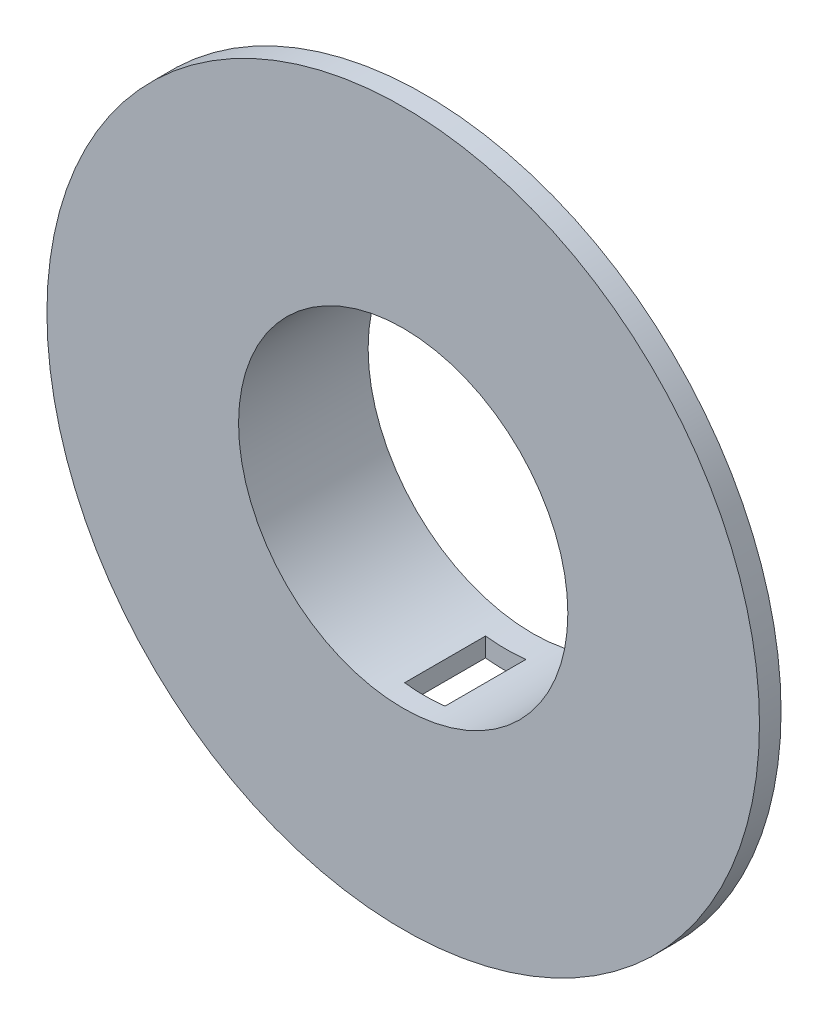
from build123d import *

# Parameters (mm, degrees)
SKETCH_4_R               = 66
EXTRUDE_2_DEPTH          = 4
SKETCH_5_R               = 30.5
CUT_EXTRUDE_1_DEPTH      = 30
SKETCH_6_R               = 34
EXTRUDE_3_DEPTH          = 20
SKETCH_7_R               = 30.5
CUT_EXTRUDE_2_DEPTH      = 97.374270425
CUT_EXTRUDE_3_DEPTH      = 96.45679651
CUT_EXTRUDE_3_DEPTH_BACK = 96.45679651
SKETCH_8_W               = 7.5
SKETCH_8_H               = 15


with BuildPart() as part:
    # Sketch 4 → Extrude 2 (new body)
    with BuildSketch(Plane.XY):
        Circle(SKETCH_4_R)
    extrude(amount=EXTRUDE_2_DEPTH)

    # Sketch 5 → Cut-Extrude 1 (cut)
    with BuildSketch(Plane.XY.offset(4)):
        Circle(SKETCH_5_R)
    extrude(amount=-CUT_EXTRUDE_1_DEPTH, mode=Mode.SUBTRACT)

    # Sketch 6 → Extrude 3 (add)
    with BuildSketch(Plane(origin=(0, 0, 0), x_dir=(-1, 0, 0), z_dir=(0, 0, -1))):
        Circle(SKETCH_6_R)
    extrude(amount=EXTRUDE_3_DEPTH)

    # Sketch 7 → Cut-Extrude 2 (cut, through all)
    with BuildSketch(Plane(origin=(0, 0, -20), x_dir=(-1, 0, 0), z_dir=(0, 0, -1))):
        with Locations(Location((0, 0, 0), (0, 0, 180))):
            Circle(SKETCH_7_R)
    extrude(amount=-CUT_EXTRUDE_2_DEPTH, mode=Mode.SUBTRACT)

    # Sketch 8 → Cut-Extrude 3 (cut, two sides: drawn at the far end of the back side and taken through both)
    with BuildSketch(Plane(origin=(0, 0, 0), x_dir=(1, 0, 0), z_dir=(0, 1, 0)).offset(-CUT_EXTRUDE_3_DEPTH_BACK)):
        with Locations((0, 7.5)):
            Rectangle(SKETCH_8_W, SKETCH_8_H)
    extrude(amount=CUT_EXTRUDE_3_DEPTH + CUT_EXTRUDE_3_DEPTH_BACK, mode=Mode.SUBTRACT)


solid = part.part
